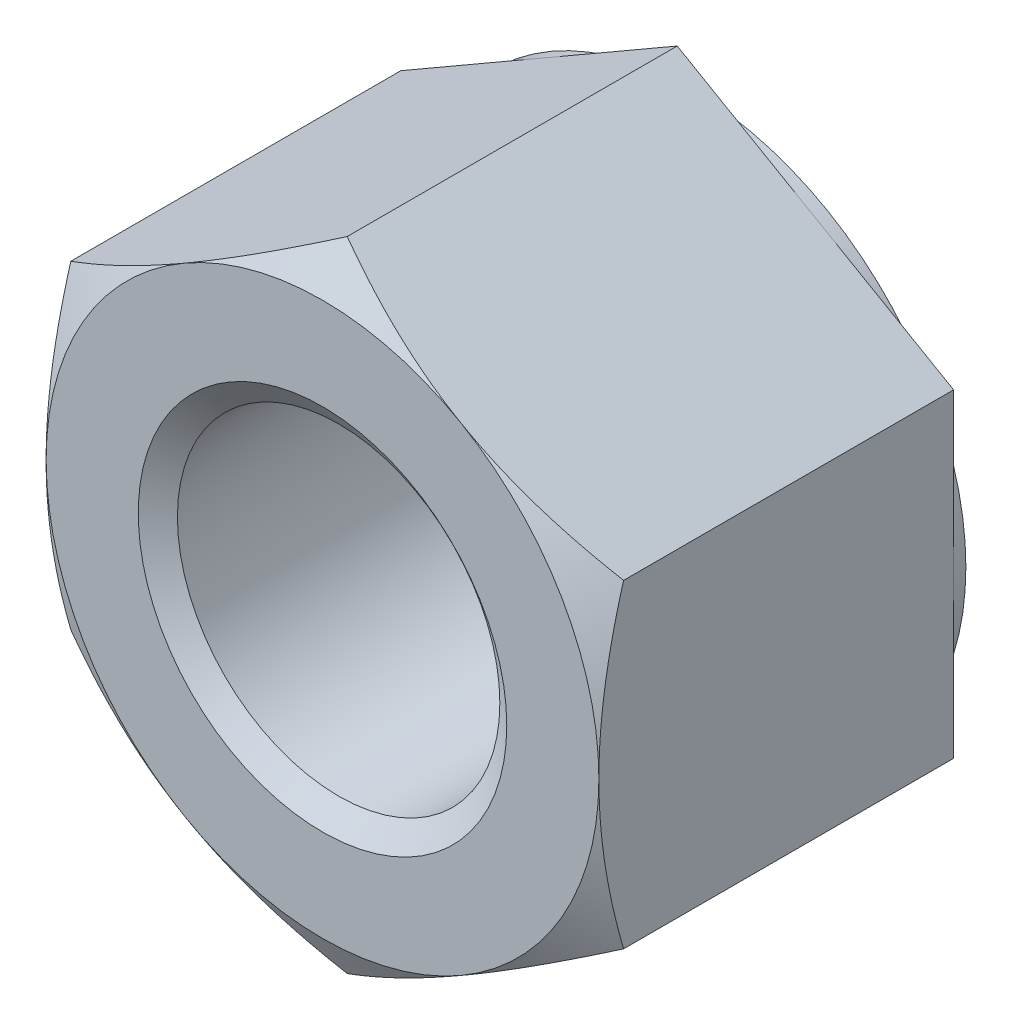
from build123d import *

# Parameters (mm, degrees)
BASENUTSKE_R  = 10.5
BASENUT_DEPTH = 23.9
SKETCH4_W     = 0.8
SKETCH4_H     = 12.784609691


with BuildPart() as part:
    # BaseNutSke → BaseNut (new body)
    with BuildSketch(Plane.XY):
        Polygon((18, 10.392304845), (18, -10.392304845), (0, -20.784609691), (-18, -10.392304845), (-18, 10.392304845), (0, 20.784609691), align=None)
        Circle(BASENUTSKE_R, mode=Mode.SUBTRACT)
    extrude(amount=-BASENUT_DEPTH)

    # Sketch4 → Bearing-Face (revolve, cut)
    with BuildSketch(Plane(origin=(0, 0, 0), x_dir=(0, 0, -1), z_dir=(1, 0, 0)), mode=Mode.PRIVATE) as bearing_face_sk:
        with Locations((23.5, 24.392304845)):
            Rectangle(SKETCH4_W, SKETCH4_H)
        Polygon((0, 18), (-10, 18), (-10, 30.784609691), (1.607695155, 30.784609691), (1.607695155, 20.784609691), align=None)
    revolve(bearing_face_sk.sketch.rotate(Axis((0, 0, 0), (0, 0, -1)), 90), axis=Axis((0, 0, 0), (0, 0, -1)), mode=Mode.SUBTRACT)

    # Sketch5 (on Right Plane) → EndChamfer (revolve, cut)
    with BuildSketch(Plane(origin=(0, 0, 0), x_dir=(0, 0, -1), z_dir=(1, 0, 0)), mode=Mode.PRIVATE) as endchamfer_sk:
        Polygon((23.9, 12), (22.849688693, 10.5), (23.9, 10.5), align=None)
        Polygon((0, 12), (1.050311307, 10.5), (0, 10.5), align=None)
    revolve(endchamfer_sk.sketch.rotate(Axis((0, 0, -25.037505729), (0, 0, -1)), 90), axis=Axis((0, 0, -25.037505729), (0, 0, -1)), mode=Mode.SUBTRACT)


solid = part.part
